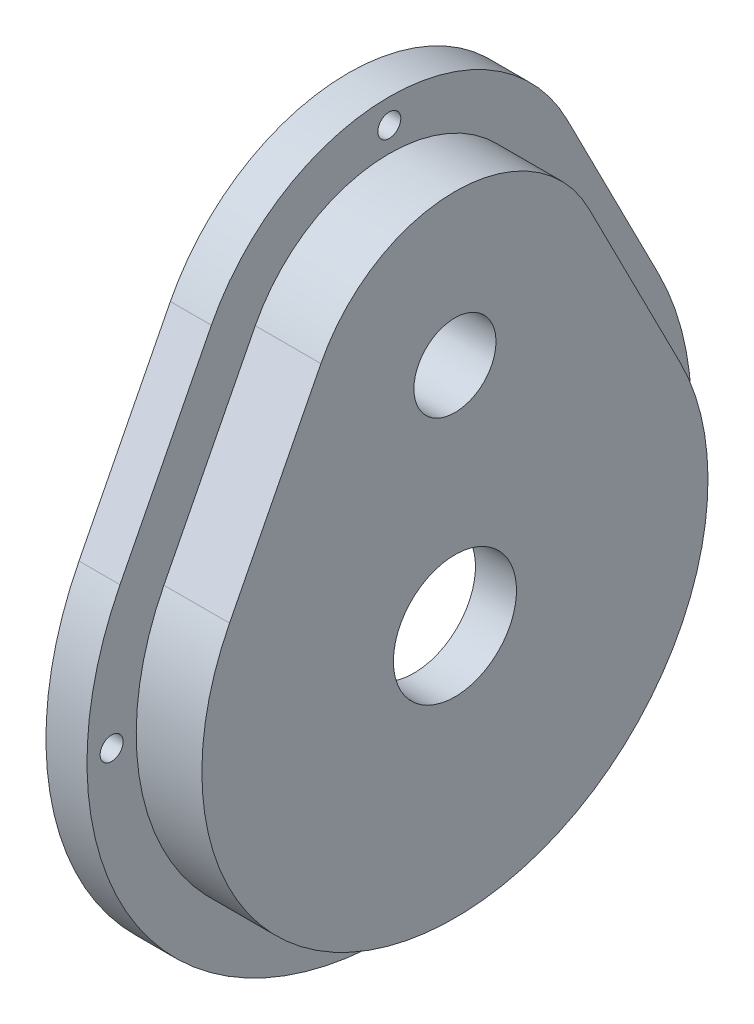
ISO-10303-21;
HEADER;
FILE_DESCRIPTION(('STEP AP214'),'2;1');
FILE_NAME('part.step','',(''),(''),'','','');
FILE_SCHEMA(('AUTOMOTIVE_DESIGN { 1 0 10303 214 1 1 1 1 }'));
ENDSEC;
DATA;
#1=APPLICATION_CONTEXT('core data for automotive mechanical design processes');
#2=APPLICATION_PROTOCOL_DEFINITION('international standard','automotive_design',2000,#1);
#3=PRODUCT_CONTEXT('',#1,'mechanical');
#4=PRODUCT('Part','Part','',(#3));
#5=PRODUCT_RELATED_PRODUCT_CATEGORY('part','',(#4));
#6=PRODUCT_DEFINITION_FORMATION('','',#4);
#7=PRODUCT_DEFINITION_CONTEXT('part definition',#1,'design');
#8=PRODUCT_DEFINITION('design','',#6,#7);
#9=PRODUCT_DEFINITION_SHAPE('','',#8);
#10=(LENGTH_UNIT() NAMED_UNIT(*) SI_UNIT(.MILLI.,.METRE.));
#11=(NAMED_UNIT(*) PLANE_ANGLE_UNIT() SI_UNIT($,.RADIAN.));
#12=(NAMED_UNIT(*) SI_UNIT($,.STERADIAN.) SOLID_ANGLE_UNIT());
#13=UNCERTAINTY_MEASURE_WITH_UNIT(LENGTH_MEASURE(1.E-05),#10,'distance_accuracy_value','');
#14=(GEOMETRIC_REPRESENTATION_CONTEXT(3) GLOBAL_UNCERTAINTY_ASSIGNED_CONTEXT((#13)) GLOBAL_UNIT_ASSIGNED_CONTEXT((#10,
#11,#12)) REPRESENTATION_CONTEXT('',''));
#15=CARTESIAN_POINT('',(0.,0.,0.));
#16=DIRECTION('',(0.,0.,1.));
#17=DIRECTION('',(1.,0.,0.));
#18=AXIS2_PLACEMENT_3D('',#15,#16,#17);
#19=CARTESIAN_POINT('',(0.,17.4625,0.));
#20=DIRECTION('',(1.,0.,0.));
#21=DIRECTION('',(0.,0.,-1.));
#22=AXIS2_PLACEMENT_3D('',#19,#20,#21);
#23=PLANE('',#22);
#24=DIRECTION('',(0.,0.890723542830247,0.454545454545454));
#25=VECTOR('',#24,1.);
#26=CARTESIAN_POINT('',(0.,7.45663181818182,-14.6119545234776));
#27=LINE('',#26,#25);
#28=CARTESIAN_POINT('',(0.,7.45663181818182,-14.6119545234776));
#29=VERTEX_POINT('',#28);
#30=CARTESIAN_POINT('',(0.,21.3111772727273,-7.54183640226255));
#31=VERTEX_POINT('',#30);
#32=EDGE_CURVE('E263',#29,#31,#27,.T.);
#33=ORIENTED_EDGE('',*,*,#32,.F.);
#34=CARTESIAN_POINT('',(0.,0.,0.));
#35=DIRECTION('',(1.,0.,0.));
#36=DIRECTION('',(0.,0.,-1.));
#37=AXIS2_PLACEMENT_3D('',#34,#35,#36);
#38=CIRCLE('',#37,16.40459);
#39=CARTESIAN_POINT('',(0.,7.45663181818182,14.6119545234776));
#40=VERTEX_POINT('',#39);
#41=EDGE_CURVE('E276',#40,#29,#38,.T.);
#42=ORIENTED_EDGE('',*,*,#41,.F.);
#43=DIRECTION('',(0.,0.890723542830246,-0.454545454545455));
#44=VECTOR('',#43,1.);
#45=CARTESIAN_POINT('',(0.,7.45663181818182,14.6119545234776));
#46=LINE('',#45,#44);
#47=CARTESIAN_POINT('',(0.,21.3111772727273,7.54183640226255));
#48=VERTEX_POINT('',#47);
#49=EDGE_CURVE('E296',#40,#48,#46,.T.);
#50=ORIENTED_EDGE('',*,*,#49,.T.);
#51=CARTESIAN_POINT('',(0.,17.4625,0.));
#52=DIRECTION('',(1.,0.,0.));
#53=DIRECTION('',(0.,0.,-1.));
#54=AXIS2_PLACEMENT_3D('',#51,#52,#53);
#55=CIRCLE('',#54,8.46709);
#56=EDGE_CURVE('E292',#31,#48,#55,.T.);
#57=ORIENTED_EDGE('',*,*,#56,.F.);
#58=EDGE_LOOP('',(#33,#42,#50,#57));
#59=FACE_BOUND('',#58,.T.);
#60=CARTESIAN_POINT('',(0.,0.,0.));
#61=DIRECTION('',(-1.,0.,0.));
#62=DIRECTION('',(0.,0.,1.));
#63=AXIS2_PLACEMENT_3D('',#60,#61,#62);
#64=CIRCLE('',#63,4.7625);
#65=CARTESIAN_POINT('',(0.,0.,4.7625));
#66=VERTEX_POINT('',#65);
#67=EDGE_CURVE('E264',#66,#66,#64,.T.);
#68=ORIENTED_EDGE('',*,*,#67,.F.);
#69=EDGE_LOOP('',(#68));
#70=FACE_BOUND('',#69,.T.);
#71=CARTESIAN_POINT('',(0.,17.4625,0.));
#72=DIRECTION('',(1.,0.,0.));
#73=DIRECTION('',(0.,0.,-1.));
#74=AXIS2_PLACEMENT_3D('',#71,#72,#73);
#75=CIRCLE('',#74,3.556);
#76=CARTESIAN_POINT('',(0.,17.4625,-3.556));
#77=VERTEX_POINT('',#76);
#78=EDGE_CURVE('E12',#77,#77,#75,.F.);
#79=ORIENTED_EDGE('',*,*,#78,.F.);
#80=EDGE_LOOP('',(#79));
#81=FACE_BOUND('',#80,.T.);
#82=ADVANCED_FACE('F71',(#59,#70,#81),#23,.F.);
#83=CARTESIAN_POINT('',(3.175,8.89981363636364,17.4400017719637));
#84=DIRECTION('',(0.,0.454545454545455,0.890723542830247));
#85=DIRECTION('',(0.,-0.890723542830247,0.454545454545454));
#86=AXIS2_PLACEMENT_3D('',#83,#84,#85);
#87=PLANE('',#86);
#88=DIRECTION('',(-1.,0.,0.));
#89=VECTOR('',#88,1.);
#90=CARTESIAN_POINT('',(3.175,22.7543590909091,10.3698836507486));
#91=LINE('',#90,#89);
#92=CARTESIAN_POINT('',(3.175,22.7543590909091,10.3698836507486));
#93=VERTEX_POINT('',#92);
#94=CARTESIAN_POINT('',(-1.905,22.7543590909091,10.3698836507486));
#95=VERTEX_POINT('',#94);
#96=EDGE_CURVE('E174',#93,#95,#91,.T.);
#97=ORIENTED_EDGE('',*,*,#96,.T.);
#98=DIRECTION('',(0.,0.890723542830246,-0.454545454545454));
#99=VECTOR('',#98,1.);
#100=CARTESIAN_POINT('',(-1.905,8.89981363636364,17.4400017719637));
#101=LINE('',#100,#99);
#102=CARTESIAN_POINT('',(-1.905,8.89981363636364,17.4400017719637));
#103=VERTEX_POINT('',#102);
#104=EDGE_CURVE('E87',#103,#95,#101,.T.);
#105=ORIENTED_EDGE('',*,*,#104,.F.);
#106=DIRECTION('',(-1.,0.,0.));
#107=VECTOR('',#106,1.);
#108=CARTESIAN_POINT('',(3.175,8.89981363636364,17.4400017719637));
#109=LINE('',#108,#107);
#110=CARTESIAN_POINT('',(3.175,8.89981363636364,17.4400017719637));
#111=VERTEX_POINT('',#110);
#112=EDGE_CURVE('E80',#111,#103,#109,.T.);
#113=ORIENTED_EDGE('',*,*,#112,.F.);
#114=DIRECTION('',(0.,0.890723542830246,-0.454545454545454));
#115=VECTOR('',#114,1.);
#116=CARTESIAN_POINT('',(3.175,8.89981363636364,17.4400017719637));
#117=LINE('',#116,#115);
#118=EDGE_CURVE('E306',#111,#93,#117,.T.);
#119=ORIENTED_EDGE('',*,*,#118,.T.);
#120=EDGE_LOOP('',(#97,#105,#113,#119));
#121=FACE_BOUND('',#120,.T.);
#122=ADVANCED_FACE('F73',(#121),#87,.T.);
#123=CARTESIAN_POINT('',(3.175,0.,0.));
#124=DIRECTION('',(-1.,0.,0.));
#125=DIRECTION('',(0.,0.,1.));
#126=AXIS2_PLACEMENT_3D('',#123,#124,#125);
#127=CYLINDRICAL_SURFACE('',#126,19.57959);
#128=CARTESIAN_POINT('',(-1.905,0.,0.));
#129=DIRECTION('',(-1.,0.,0.));
#130=DIRECTION('',(0.,0.,1.));
#131=AXIS2_PLACEMENT_3D('',#128,#129,#130);
#132=CIRCLE('',#131,19.57959);
#133=CARTESIAN_POINT('',(-1.905,8.89981363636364,-17.4400017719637));
#134=VERTEX_POINT('',#133);
#135=EDGE_CURVE('E94',#134,#103,#132,.T.);
#136=ORIENTED_EDGE('',*,*,#135,.F.);
#137=DIRECTION('',(-1.,0.,0.));
#138=VECTOR('',#137,1.);
#139=CARTESIAN_POINT('',(3.175,8.89981363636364,-17.4400017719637));
#140=LINE('',#139,#138);
#141=CARTESIAN_POINT('',(3.175,8.89981363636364,-17.4400017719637));
#142=VERTEX_POINT('',#141);
#143=EDGE_CURVE('E173',#142,#134,#140,.T.);
#144=ORIENTED_EDGE('',*,*,#143,.F.);
#145=CARTESIAN_POINT('',(3.175,0.,0.));
#146=DIRECTION('',(1.,0.,0.));
#147=DIRECTION('',(0.,0.,-1.));
#148=AXIS2_PLACEMENT_3D('',#145,#146,#147);
#149=CIRCLE('',#148,19.57959);
#150=EDGE_CURVE('E326',#111,#142,#149,.T.);
#151=ORIENTED_EDGE('',*,*,#150,.F.);
#152=ORIENTED_EDGE('',*,*,#112,.T.);
#153=EDGE_LOOP('',(#136,#144,#151,#152));
#154=FACE_BOUND('',#153,.T.);
#155=ADVANCED_FACE('F337',(#154),#127,.T.);
#156=CARTESIAN_POINT('',(3.175,8.89981363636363,-17.4400017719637));
#157=DIRECTION('',(0.,-0.454545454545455,0.890723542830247));
#158=DIRECTION('',(0.,-0.890723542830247,-0.454545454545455));
#159=AXIS2_PLACEMENT_3D('',#156,#157,#158);
#160=PLANE('',#159);
#161=DIRECTION('',(0.,-0.890723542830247,-0.454545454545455));
#162=VECTOR('',#161,1.);
#163=CARTESIAN_POINT('',(-1.905,8.89981363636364,-17.4400017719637));
#164=LINE('',#163,#162);
#165=CARTESIAN_POINT('',(-1.905,22.7543590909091,-10.3698836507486));
#166=VERTEX_POINT('',#165);
#167=EDGE_CURVE('E177',#166,#134,#164,.T.);
#168=ORIENTED_EDGE('',*,*,#167,.F.);
#169=DIRECTION('',(-1.,0.,0.));
#170=VECTOR('',#169,1.);
#171=CARTESIAN_POINT('',(3.175,22.7543590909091,-10.3698836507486));
#172=LINE('',#171,#170);
#173=CARTESIAN_POINT('',(3.175,22.7543590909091,-10.3698836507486));
#174=VERTEX_POINT('',#173);
#175=EDGE_CURVE('E163',#174,#166,#172,.T.);
#176=ORIENTED_EDGE('',*,*,#175,.F.);
#177=DIRECTION('',(0.,0.890723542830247,0.454545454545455));
#178=VECTOR('',#177,1.);
#179=CARTESIAN_POINT('',(3.175,8.89981363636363,-17.4400017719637));
#180=LINE('',#179,#178);
#181=EDGE_CURVE('E323',#142,#174,#180,.T.);
#182=ORIENTED_EDGE('',*,*,#181,.F.);
#183=ORIENTED_EDGE('',*,*,#143,.T.);
#184=EDGE_LOOP('',(#168,#176,#182,#183));
#185=FACE_BOUND('',#184,.T.);
#186=ADVANCED_FACE('F178',(#185),#160,.F.);
#187=CARTESIAN_POINT('',(3.175,17.4625,0.));
#188=DIRECTION('',(-1.,0.,0.));
#189=DIRECTION('',(0.,0.,1.));
#190=AXIS2_PLACEMENT_3D('',#187,#188,#189);
#191=CYLINDRICAL_SURFACE('',#190,11.64209);
#192=CARTESIAN_POINT('',(-1.905,17.4625,0.));
#193=DIRECTION('',(-1.,0.,0.));
#194=DIRECTION('',(0.,0.,1.));
#195=AXIS2_PLACEMENT_3D('',#192,#193,#194);
#196=CIRCLE('',#195,11.64209);
#197=EDGE_CURVE('E168',#95,#166,#196,.T.);
#198=ORIENTED_EDGE('',*,*,#197,.F.);
#199=ORIENTED_EDGE('',*,*,#96,.F.);
#200=CARTESIAN_POINT('',(3.175,17.4625,0.));
#201=DIRECTION('',(1.,0.,0.));
#202=DIRECTION('',(0.,0.,-1.));
#203=AXIS2_PLACEMENT_3D('',#200,#201,#202);
#204=CIRCLE('',#203,11.64209);
#205=EDGE_CURVE('E169',#174,#93,#204,.T.);
#206=ORIENTED_EDGE('',*,*,#205,.F.);
#207=ORIENTED_EDGE('',*,*,#175,.T.);
#208=EDGE_LOOP('',(#198,#199,#206,#207));
#209=FACE_BOUND('',#208,.T.);
#210=ADVANCED_FACE('F165',(#209),#191,.T.);
#211=CARTESIAN_POINT('',(3.175,17.4625,0.));
#212=DIRECTION('',(1.,0.,0.));
#213=DIRECTION('',(0.,0.,-1.));
#214=AXIS2_PLACEMENT_3D('',#211,#212,#213);
#215=PLANE('',#214);
#216=CARTESIAN_POINT('',(3.175,0.,0.));
#217=DIRECTION('',(-1.,0.,0.));
#218=DIRECTION('',(0.,0.,1.));
#219=AXIS2_PLACEMENT_3D('',#216,#217,#218);
#220=CIRCLE('',#219,4.7625);
#221=CARTESIAN_POINT('',(3.175,0.,4.7625));
#222=VERTEX_POINT('',#221);
#223=EDGE_CURVE('E259',#222,#222,#220,.T.);
#224=ORIENTED_EDGE('',*,*,#223,.T.);
#225=EDGE_LOOP('',(#224));
#226=FACE_BOUND('',#225,.T.);
#227=CARTESIAN_POINT('',(3.175,17.4625,0.));
#228=DIRECTION('',(-1.,0.,0.));
#229=DIRECTION('',(0.,0.,1.));
#230=AXIS2_PLACEMENT_3D('',#227,#228,#229);
#231=CIRCLE('',#230,3.175);
#232=CARTESIAN_POINT('',(3.175,17.4625,3.175));
#233=VERTEX_POINT('',#232);
#234=EDGE_CURVE('E250',#233,#233,#231,.T.);
#235=ORIENTED_EDGE('',*,*,#234,.T.);
#236=EDGE_LOOP('',(#235));
#237=FACE_BOUND('',#236,.T.);
#238=ORIENTED_EDGE('',*,*,#118,.F.);
#239=ORIENTED_EDGE('',*,*,#150,.T.);
#240=ORIENTED_EDGE('',*,*,#181,.T.);
#241=ORIENTED_EDGE('',*,*,#205,.T.);
#242=EDGE_LOOP('',(#238,#239,#240,#241));
#243=FACE_BOUND('',#242,.T.);
#244=ADVANCED_FACE('F336',(#226,#237,#243),#215,.T.);
#245=CARTESIAN_POINT('',(-5.08,17.4625,0.));
#246=DIRECTION('',(1.,0.,0.));
#247=DIRECTION('',(0.,0.,-1.));
#248=AXIS2_PLACEMENT_3D('',#245,#246,#247);
#249=PLANE('',#248);
#250=CARTESIAN_POINT('',(-5.08,0.,0.));
#251=DIRECTION('',(1.,0.,0.));
#252=DIRECTION('',(0.,0.,-1.));
#253=AXIS2_PLACEMENT_3D('',#250,#251,#252);
#254=CIRCLE('',#253,16.40459);
#255=CARTESIAN_POINT('',(-5.08,7.45663181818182,14.6119545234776));
#256=VERTEX_POINT('',#255);
#257=CARTESIAN_POINT('',(-5.08,7.45663181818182,-14.6119545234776));
#258=VERTEX_POINT('',#257);
#259=EDGE_CURVE('E284',#256,#258,#254,.T.);
#260=ORIENTED_EDGE('',*,*,#259,.T.);
#261=DIRECTION('',(0.,0.890723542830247,0.454545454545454));
#262=VECTOR('',#261,1.);
#263=CARTESIAN_POINT('',(-5.08,7.45663181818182,-14.6119545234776));
#264=LINE('',#263,#262);
#265=CARTESIAN_POINT('',(-5.08,21.3111772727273,-7.54183640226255));
#266=VERTEX_POINT('',#265);
#267=EDGE_CURVE('E271',#258,#266,#264,.T.);
#268=ORIENTED_EDGE('',*,*,#267,.T.);
#269=CARTESIAN_POINT('',(-5.08,17.4625,0.));
#270=DIRECTION('',(1.,0.,0.));
#271=DIRECTION('',(0.,0.,-1.));
#272=AXIS2_PLACEMENT_3D('',#269,#270,#271);
#273=CIRCLE('',#272,8.46709);
#274=CARTESIAN_POINT('',(-5.08,21.3111772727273,7.54183640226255));
#275=VERTEX_POINT('',#274);
#276=EDGE_CURVE('E275',#266,#275,#273,.T.);
#277=ORIENTED_EDGE('',*,*,#276,.T.);
#278=DIRECTION('',(0.,0.890723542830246,-0.454545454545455));
#279=VECTOR('',#278,1.);
#280=CARTESIAN_POINT('',(-5.08,7.45663181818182,14.6119545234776));
#281=LINE('',#280,#279);
#282=EDGE_CURVE('E280',#256,#275,#281,.T.);
#283=ORIENTED_EDGE('',*,*,#282,.F.);
#284=EDGE_LOOP('',(#260,#268,#277,#283));
#285=FACE_BOUND('',#284,.T.);
#286=CARTESIAN_POINT('',(-5.08,0.,-21.48459));
#287=DIRECTION('',(-1.,0.,0.));
#288=DIRECTION('',(0.,0.,1.));
#289=AXIS2_PLACEMENT_3D('',#286,#287,#288);
#290=CIRCLE('',#289,0.889);
#291=CARTESIAN_POINT('',(-5.08,0.,-20.59559));
#292=VERTEX_POINT('',#291);
#293=EDGE_CURVE('E438',#292,#292,#290,.T.);
#294=ORIENTED_EDGE('',*,*,#293,.F.);
#295=EDGE_LOOP('',(#294));
#296=FACE_BOUND('',#295,.T.);
#297=CARTESIAN_POINT('',(-5.08,0.,21.48459));
#298=DIRECTION('',(-1.,0.,0.));
#299=DIRECTION('',(0.,0.,1.));
#300=AXIS2_PLACEMENT_3D('',#297,#298,#299);
#301=CIRCLE('',#300,0.889);
#302=CARTESIAN_POINT('',(-5.08,0.,22.37359));
#303=VERTEX_POINT('',#302);
#304=EDGE_CURVE('E181',#303,#303,#301,.T.);
#305=ORIENTED_EDGE('',*,*,#304,.F.);
#306=EDGE_LOOP('',(#305));
#307=FACE_BOUND('',#306,.T.);
#308=CARTESIAN_POINT('',(-5.08,-21.48459,0.));
#309=DIRECTION('',(-1.,0.,0.));
#310=DIRECTION('',(0.,0.,1.));
#311=AXIS2_PLACEMENT_3D('',#308,#309,#310);
#312=CIRCLE('',#311,0.889);
#313=CARTESIAN_POINT('',(-5.08,-21.48459,0.889));
#314=VERTEX_POINT('',#313);
#315=EDGE_CURVE('E195',#314,#314,#312,.T.);
#316=ORIENTED_EDGE('',*,*,#315,.F.);
#317=EDGE_LOOP('',(#316));
#318=FACE_BOUND('',#317,.T.);
#319=CARTESIAN_POINT('',(-5.08,31.00959,0.));
#320=DIRECTION('',(-1.,0.,0.));
#321=DIRECTION('',(0.,0.,1.));
#322=AXIS2_PLACEMENT_3D('',#319,#320,#321);
#323=CIRCLE('',#322,0.889);
#324=CARTESIAN_POINT('',(-5.08,31.00959,0.889));
#325=VERTEX_POINT('',#324);
#326=EDGE_CURVE('E203',#325,#325,#323,.T.);
#327=ORIENTED_EDGE('',*,*,#326,.F.);
#328=EDGE_LOOP('',(#327));
#329=FACE_BOUND('',#328,.T.);
#330=CARTESIAN_POINT('',(-5.08,17.4625,0.));
#331=DIRECTION('',(-1.,0.,0.));
#332=DIRECTION('',(0.,0.,1.));
#333=AXIS2_PLACEMENT_3D('',#330,#331,#332);
#334=CIRCLE('',#333,15.45209);
#335=CARTESIAN_POINT('',(-5.08,24.4861772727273,13.7635403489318));
#336=VERTEX_POINT('',#335);
#337=CARTESIAN_POINT('',(-5.08,24.4861772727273,-13.7635403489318));
#338=VERTEX_POINT('',#337);
#339=EDGE_CURVE('E211',#336,#338,#334,.T.);
#340=ORIENTED_EDGE('',*,*,#339,.T.);
#341=DIRECTION('',(0.,-0.890723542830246,-0.454545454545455));
#342=VECTOR('',#341,1.);
#343=CARTESIAN_POINT('',(-5.08,24.4861772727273,-13.7635403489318));
#344=LINE('',#343,#342);
#345=CARTESIAN_POINT('',(-5.08,10.6316318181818,-20.8336584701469));
#346=VERTEX_POINT('',#345);
#347=EDGE_CURVE('E236',#338,#346,#344,.T.);
#348=ORIENTED_EDGE('',*,*,#347,.T.);
#349=CARTESIAN_POINT('',(-5.08,0.,0.));
#350=DIRECTION('',(-1.,0.,0.));
#351=DIRECTION('',(0.,0.,1.));
#352=AXIS2_PLACEMENT_3D('',#349,#350,#351);
#353=CIRCLE('',#352,23.38959);
#354=CARTESIAN_POINT('',(-5.08,10.6316318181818,20.8336584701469));
#355=VERTEX_POINT('',#354);
#356=EDGE_CURVE('E240',#346,#355,#353,.T.);
#357=ORIENTED_EDGE('',*,*,#356,.T.);
#358=DIRECTION('',(0.,0.890723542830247,-0.454545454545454));
#359=VECTOR('',#358,1.);
#360=CARTESIAN_POINT('',(-5.08,10.6316318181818,20.8336584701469));
#361=LINE('',#360,#359);
#362=EDGE_CURVE('E220',#355,#336,#361,.T.);
#363=ORIENTED_EDGE('',*,*,#362,.T.);
#364=EDGE_LOOP('',(#340,#348,#357,#363));
#365=FACE_BOUND('',#364,.T.);
#366=ADVANCED_FACE('F356',(#285,#296,#307,#318,#329,#365),#249,.F.);
#367=CARTESIAN_POINT('',(-5.08,7.45663181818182,-14.6119545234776));
#368=DIRECTION('',(0.,0.454545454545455,-0.890723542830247));
#369=DIRECTION('',(0.,0.890723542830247,0.454545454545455));
#370=AXIS2_PLACEMENT_3D('',#367,#368,#369);
#371=PLANE('',#370);
#372=ORIENTED_EDGE('',*,*,#32,.T.);
#373=DIRECTION('',(1.,0.,0.));
#374=VECTOR('',#373,1.);
#375=CARTESIAN_POINT('',(-5.08,21.3111772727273,-7.54183640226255));
#376=LINE('',#375,#374);
#377=EDGE_CURVE('E288',#266,#31,#376,.T.);
#378=ORIENTED_EDGE('',*,*,#377,.F.);
#379=ORIENTED_EDGE('',*,*,#267,.F.);
#380=DIRECTION('',(1.,0.,0.));
#381=VECTOR('',#380,1.);
#382=CARTESIAN_POINT('',(-5.08,7.45663181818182,-14.6119545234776));
#383=LINE('',#382,#381);
#384=EDGE_CURVE('E302',#258,#29,#383,.T.);
#385=ORIENTED_EDGE('',*,*,#384,.T.);
#386=EDGE_LOOP('',(#372,#378,#379,#385));
#387=FACE_BOUND('',#386,.T.);
#388=ADVANCED_FACE('F360',(#387),#371,.F.);
#389=CARTESIAN_POINT('',(-5.08,0.,0.));
#390=DIRECTION('',(1.,0.,0.));
#391=DIRECTION('',(0.,0.,-1.));
#392=AXIS2_PLACEMENT_3D('',#389,#390,#391);
#393=CYLINDRICAL_SURFACE('',#392,16.40459);
#394=ORIENTED_EDGE('',*,*,#41,.T.);
#395=ORIENTED_EDGE('',*,*,#384,.F.);
#396=ORIENTED_EDGE('',*,*,#259,.F.);
#397=DIRECTION('',(1.,0.,0.));
#398=VECTOR('',#397,1.);
#399=CARTESIAN_POINT('',(-5.08,7.45663181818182,14.6119545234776));
#400=LINE('',#399,#398);
#401=EDGE_CURVE('E307',#256,#40,#400,.T.);
#402=ORIENTED_EDGE('',*,*,#401,.T.);
#403=EDGE_LOOP('',(#394,#395,#396,#402));
#404=FACE_BOUND('',#403,.T.);
#405=ADVANCED_FACE('F364',(#404),#393,.F.);
#406=CARTESIAN_POINT('',(-5.08,7.45663181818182,14.6119545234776));
#407=DIRECTION('',(0.,-0.454545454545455,-0.890723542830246));
#408=DIRECTION('',(0.,0.890723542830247,-0.454545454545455));
#409=AXIS2_PLACEMENT_3D('',#406,#407,#408);
#410=PLANE('',#409);
#411=ORIENTED_EDGE('',*,*,#49,.F.);
#412=ORIENTED_EDGE('',*,*,#401,.F.);
#413=ORIENTED_EDGE('',*,*,#282,.T.);
#414=DIRECTION('',(1.,0.,0.));
#415=VECTOR('',#414,1.);
#416=CARTESIAN_POINT('',(-5.08,21.3111772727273,7.54183640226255));
#417=LINE('',#416,#415);
#418=EDGE_CURVE('E311',#275,#48,#417,.T.);
#419=ORIENTED_EDGE('',*,*,#418,.T.);
#420=EDGE_LOOP('',(#411,#412,#413,#419));
#421=FACE_BOUND('',#420,.T.);
#422=ADVANCED_FACE('F370',(#421),#410,.T.);
#423=CARTESIAN_POINT('',(-5.08,17.4625,0.));
#424=DIRECTION('',(1.,0.,0.));
#425=DIRECTION('',(0.,0.,-1.));
#426=AXIS2_PLACEMENT_3D('',#423,#424,#425);
#427=CYLINDRICAL_SURFACE('',#426,8.46709);
#428=ORIENTED_EDGE('',*,*,#56,.T.);
#429=ORIENTED_EDGE('',*,*,#418,.F.);
#430=ORIENTED_EDGE('',*,*,#276,.F.);
#431=ORIENTED_EDGE('',*,*,#377,.T.);
#432=EDGE_LOOP('',(#428,#429,#430,#431));
#433=FACE_BOUND('',#432,.T.);
#434=ADVANCED_FACE('F366',(#433),#427,.F.);
#435=CARTESIAN_POINT('',(3.175,17.4625,0.));
#436=DIRECTION('',(-1.,0.,0.));
#437=DIRECTION('',(0.,0.,1.));
#438=AXIS2_PLACEMENT_3D('',#435,#436,#437);
#439=CYLINDRICAL_SURFACE('',#438,3.175);
#440=ORIENTED_EDGE('',*,*,#234,.F.);
#441=EDGE_LOOP('',(#440));
#442=FACE_BOUND('',#441,.T.);
#443=CARTESIAN_POINT('',(-1.524,17.4625,0.));
#444=DIRECTION('',(-1.,0.,0.));
#445=DIRECTION('',(0.,0.,1.));
#446=AXIS2_PLACEMENT_3D('',#443,#444,#445);
#447=CIRCLE('',#446,3.17500000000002);
#448=CARTESIAN_POINT('',(-1.524,17.4625,3.17500000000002));
#449=VERTEX_POINT('',#448);
#450=EDGE_CURVE('E433',#449,#449,#447,.T.);
#451=ORIENTED_EDGE('',*,*,#450,.T.);
#452=EDGE_LOOP('',(#451));
#453=FACE_BOUND('',#452,.T.);
#454=ADVANCED_FACE('F369',(#442,#453),#439,.F.);
#455=CARTESIAN_POINT('',(3.175,0.,0.));
#456=DIRECTION('',(-1.,0.,0.));
#457=DIRECTION('',(0.,0.,1.));
#458=AXIS2_PLACEMENT_3D('',#455,#456,#457);
#459=CYLINDRICAL_SURFACE('',#458,4.7625);
#460=ORIENTED_EDGE('',*,*,#223,.F.);
#461=EDGE_LOOP('',(#460));
#462=FACE_BOUND('',#461,.T.);
#463=ORIENTED_EDGE('',*,*,#67,.T.);
#464=EDGE_LOOP('',(#463));
#465=FACE_BOUND('',#464,.T.);
#466=ADVANCED_FACE('F379',(#462,#465),#459,.F.);
#467=CARTESIAN_POINT('',(-1.905,17.4625,0.));
#468=DIRECTION('',(-1.,0.,0.));
#469=DIRECTION('',(0.,0.,1.));
#470=AXIS2_PLACEMENT_3D('',#467,#468,#469);
#471=CYLINDRICAL_SURFACE('',#470,15.45209);
#472=ORIENTED_EDGE('',*,*,#339,.F.);
#473=DIRECTION('',(-1.,0.,0.));
#474=VECTOR('',#473,1.);
#475=CARTESIAN_POINT('',(-1.905,24.4861772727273,13.7635403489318));
#476=LINE('',#475,#474);
#477=CARTESIAN_POINT('',(-1.905,24.4861772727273,13.7635403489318));
#478=VERTEX_POINT('',#477);
#479=EDGE_CURVE('E247',#478,#336,#476,.T.);
#480=ORIENTED_EDGE('',*,*,#479,.F.);
#481=CARTESIAN_POINT('',(-1.905,17.4625,0.));
#482=DIRECTION('',(-1.,0.,0.));
#483=DIRECTION('',(0.,0.,1.));
#484=AXIS2_PLACEMENT_3D('',#481,#482,#483);
#485=CIRCLE('',#484,15.45209);
#486=CARTESIAN_POINT('',(-1.905,24.4861772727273,-13.7635403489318));
#487=VERTEX_POINT('',#486);
#488=EDGE_CURVE('E215',#478,#487,#485,.T.);
#489=ORIENTED_EDGE('',*,*,#488,.T.);
#490=DIRECTION('',(-1.,0.,0.));
#491=VECTOR('',#490,1.);
#492=CARTESIAN_POINT('',(-1.905,24.4861772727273,-13.7635403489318));
#493=LINE('',#492,#491);
#494=EDGE_CURVE('E232',#487,#338,#493,.T.);
#495=ORIENTED_EDGE('',*,*,#494,.T.);
#496=EDGE_LOOP('',(#472,#480,#489,#495));
#497=FACE_BOUND('',#496,.T.);
#498=ADVANCED_FACE('F383',(#497),#471,.T.);
#499=CARTESIAN_POINT('',(-1.905,10.6316318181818,20.8336584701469));
#500=DIRECTION('',(0.,0.454545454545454,0.890723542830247));
#501=DIRECTION('',(0.,-0.890723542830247,0.454545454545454));
#502=AXIS2_PLACEMENT_3D('',#499,#500,#501);
#503=PLANE('',#502);
#504=ORIENTED_EDGE('',*,*,#362,.F.);
#505=DIRECTION('',(-1.,0.,0.));
#506=VECTOR('',#505,1.);
#507=CARTESIAN_POINT('',(-1.905,10.6316318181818,20.8336584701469));
#508=LINE('',#507,#506);
#509=CARTESIAN_POINT('',(-1.905,10.6316318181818,20.8336584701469));
#510=VERTEX_POINT('',#509);
#511=EDGE_CURVE('E251',#510,#355,#508,.T.);
#512=ORIENTED_EDGE('',*,*,#511,.F.);
#513=DIRECTION('',(0.,0.890723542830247,-0.454545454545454));
#514=VECTOR('',#513,1.);
#515=CARTESIAN_POINT('',(-1.905,10.6316318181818,20.8336584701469));
#516=LINE('',#515,#514);
#517=EDGE_CURVE('E228',#510,#478,#516,.T.);
#518=ORIENTED_EDGE('',*,*,#517,.T.);
#519=ORIENTED_EDGE('',*,*,#479,.T.);
#520=EDGE_LOOP('',(#504,#512,#518,#519));
#521=FACE_BOUND('',#520,.T.);
#522=ADVANCED_FACE('F387',(#521),#503,.T.);
#523=CARTESIAN_POINT('',(-1.905,0.,0.));
#524=DIRECTION('',(-1.,0.,0.));
#525=DIRECTION('',(0.,0.,1.));
#526=AXIS2_PLACEMENT_3D('',#523,#524,#525);
#527=CYLINDRICAL_SURFACE('',#526,23.38959);
#528=ORIENTED_EDGE('',*,*,#356,.F.);
#529=DIRECTION('',(-1.,0.,0.));
#530=VECTOR('',#529,1.);
#531=CARTESIAN_POINT('',(-1.905,10.6316318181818,-20.8336584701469));
#532=LINE('',#531,#530);
#533=CARTESIAN_POINT('',(-1.905,10.6316318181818,-20.8336584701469));
#534=VERTEX_POINT('',#533);
#535=EDGE_CURVE('E254',#534,#346,#532,.T.);
#536=ORIENTED_EDGE('',*,*,#535,.F.);
#537=CARTESIAN_POINT('',(-1.905,0.,0.));
#538=DIRECTION('',(-1.,0.,0.));
#539=DIRECTION('',(0.,0.,1.));
#540=AXIS2_PLACEMENT_3D('',#537,#538,#539);
#541=CIRCLE('',#540,23.38959);
#542=EDGE_CURVE('E224',#534,#510,#541,.T.);
#543=ORIENTED_EDGE('',*,*,#542,.T.);
#544=ORIENTED_EDGE('',*,*,#511,.T.);
#545=EDGE_LOOP('',(#528,#536,#543,#544));
#546=FACE_BOUND('',#545,.T.);
#547=ADVANCED_FACE('F392',(#546),#527,.T.);
#548=CARTESIAN_POINT('',(-1.905,24.4861772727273,-13.7635403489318));
#549=DIRECTION('',(0.,0.454545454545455,-0.890723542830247));
#550=DIRECTION('',(0.,0.890723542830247,0.454545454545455));
#551=AXIS2_PLACEMENT_3D('',#548,#549,#550);
#552=PLANE('',#551);
#553=ORIENTED_EDGE('',*,*,#347,.F.);
#554=ORIENTED_EDGE('',*,*,#494,.F.);
#555=DIRECTION('',(0.,-0.890723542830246,-0.454545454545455));
#556=VECTOR('',#555,1.);
#557=CARTESIAN_POINT('',(-1.905,24.4861772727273,-13.7635403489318));
#558=LINE('',#557,#556);
#559=EDGE_CURVE('E219',#487,#534,#558,.T.);
#560=ORIENTED_EDGE('',*,*,#559,.T.);
#561=ORIENTED_EDGE('',*,*,#535,.T.);
#562=EDGE_LOOP('',(#553,#554,#560,#561));
#563=FACE_BOUND('',#562,.T.);
#564=ADVANCED_FACE('F389',(#563),#552,.T.);
#565=CARTESIAN_POINT('',(-1.905,17.4625,0.));
#566=DIRECTION('',(-1.,0.,0.));
#567=DIRECTION('',(0.,0.,1.));
#568=AXIS2_PLACEMENT_3D('',#565,#566,#567);
#569=PLANE('',#568);
#570=CARTESIAN_POINT('',(-1.905,0.,-21.48459));
#571=DIRECTION('',(-1.,0.,0.));
#572=DIRECTION('',(0.,0.,1.));
#573=AXIS2_PLACEMENT_3D('',#570,#571,#572);
#574=CIRCLE('',#573,0.889);
#575=CARTESIAN_POINT('',(-1.905,0.,-20.59559));
#576=VERTEX_POINT('',#575);
#577=EDGE_CURVE('E441',#576,#576,#574,.T.);
#578=ORIENTED_EDGE('',*,*,#577,.T.);
#579=EDGE_LOOP('',(#578));
#580=FACE_BOUND('',#579,.T.);
#581=ORIENTED_EDGE('',*,*,#167,.T.);
#582=ORIENTED_EDGE('',*,*,#135,.T.);
#583=ORIENTED_EDGE('',*,*,#104,.T.);
#584=ORIENTED_EDGE('',*,*,#197,.T.);
#585=EDGE_LOOP('',(#581,#582,#583,#584));
#586=FACE_BOUND('',#585,.T.);
#587=CARTESIAN_POINT('',(-1.905,0.,21.48459));
#588=DIRECTION('',(-1.,0.,0.));
#589=DIRECTION('',(0.,0.,1.));
#590=AXIS2_PLACEMENT_3D('',#587,#588,#589);
#591=CIRCLE('',#590,0.889);
#592=CARTESIAN_POINT('',(-1.905,0.,22.37359));
#593=VERTEX_POINT('',#592);
#594=EDGE_CURVE('E191',#593,#593,#591,.T.);
#595=ORIENTED_EDGE('',*,*,#594,.T.);
#596=EDGE_LOOP('',(#595));
#597=FACE_BOUND('',#596,.T.);
#598=CARTESIAN_POINT('',(-1.905,-21.48459,0.));
#599=DIRECTION('',(-1.,0.,0.));
#600=DIRECTION('',(0.,0.,1.));
#601=AXIS2_PLACEMENT_3D('',#598,#599,#600);
#602=CIRCLE('',#601,0.889);
#603=CARTESIAN_POINT('',(-1.905,-21.48459,0.889));
#604=VERTEX_POINT('',#603);
#605=EDGE_CURVE('E199',#604,#604,#602,.T.);
#606=ORIENTED_EDGE('',*,*,#605,.T.);
#607=EDGE_LOOP('',(#606));
#608=FACE_BOUND('',#607,.T.);
#609=CARTESIAN_POINT('',(-1.905,31.00959,0.));
#610=DIRECTION('',(-1.,0.,0.));
#611=DIRECTION('',(0.,0.,1.));
#612=AXIS2_PLACEMENT_3D('',#609,#610,#611);
#613=CIRCLE('',#612,0.889);
#614=CARTESIAN_POINT('',(-1.905,31.00959,0.889));
#615=VERTEX_POINT('',#614);
#616=EDGE_CURVE('E207',#615,#615,#613,.T.);
#617=ORIENTED_EDGE('',*,*,#616,.T.);
#618=EDGE_LOOP('',(#617));
#619=FACE_BOUND('',#618,.T.);
#620=ORIENTED_EDGE('',*,*,#488,.F.);
#621=ORIENTED_EDGE('',*,*,#517,.F.);
#622=ORIENTED_EDGE('',*,*,#542,.F.);
#623=ORIENTED_EDGE('',*,*,#559,.F.);
#624=EDGE_LOOP('',(#620,#621,#622,#623));
#625=FACE_BOUND('',#624,.T.);
#626=ADVANCED_FACE('F183',(#580,#586,#597,#608,#619,#625),#569,.F.);
#627=CARTESIAN_POINT('',(-1.905,31.00959,0.));
#628=DIRECTION('',(-1.,0.,0.));
#629=DIRECTION('',(0.,0.,1.));
#630=AXIS2_PLACEMENT_3D('',#627,#628,#629);
#631=CYLINDRICAL_SURFACE('',#630,0.889);
#632=ORIENTED_EDGE('',*,*,#616,.F.);
#633=EDGE_LOOP('',(#632));
#634=FACE_BOUND('',#633,.T.);
#635=ORIENTED_EDGE('',*,*,#326,.T.);
#636=EDGE_LOOP('',(#635));
#637=FACE_BOUND('',#636,.T.);
#638=ADVANCED_FACE('F402',(#634,#637),#631,.F.);
#639=CARTESIAN_POINT('',(-1.905,-21.48459,0.));
#640=DIRECTION('',(-1.,0.,0.));
#641=DIRECTION('',(0.,0.,1.));
#642=AXIS2_PLACEMENT_3D('',#639,#640,#641);
#643=CYLINDRICAL_SURFACE('',#642,0.889);
#644=ORIENTED_EDGE('',*,*,#605,.F.);
#645=EDGE_LOOP('',(#644));
#646=FACE_BOUND('',#645,.T.);
#647=ORIENTED_EDGE('',*,*,#315,.T.);
#648=EDGE_LOOP('',(#647));
#649=FACE_BOUND('',#648,.T.);
#650=ADVANCED_FACE('F406',(#646,#649),#643,.F.);
#651=CARTESIAN_POINT('',(-1.905,0.,21.48459));
#652=DIRECTION('',(-1.,0.,0.));
#653=DIRECTION('',(0.,0.,1.));
#654=AXIS2_PLACEMENT_3D('',#651,#652,#653);
#655=CYLINDRICAL_SURFACE('',#654,0.889);
#656=ORIENTED_EDGE('',*,*,#594,.F.);
#657=EDGE_LOOP('',(#656));
#658=FACE_BOUND('',#657,.T.);
#659=ORIENTED_EDGE('',*,*,#304,.T.);
#660=EDGE_LOOP('',(#659));
#661=FACE_BOUND('',#660,.T.);
#662=ADVANCED_FACE('F410',(#658,#661),#655,.F.);
#663=CARTESIAN_POINT('',(-1.905,0.,-21.48459));
#664=DIRECTION('',(-1.,0.,0.));
#665=DIRECTION('',(0.,0.,1.));
#666=AXIS2_PLACEMENT_3D('',#663,#664,#665);
#667=CYLINDRICAL_SURFACE('',#666,0.889);
#668=ORIENTED_EDGE('',*,*,#577,.F.);
#669=EDGE_LOOP('',(#668));
#670=FACE_BOUND('',#669,.T.);
#671=ORIENTED_EDGE('',*,*,#293,.T.);
#672=EDGE_LOOP('',(#671));
#673=FACE_BOUND('',#672,.T.);
#674=ADVANCED_FACE('F414',(#670,#673),#667,.F.);
#675=CARTESIAN_POINT('',(-1.524,17.4625,0.));
#676=DIRECTION('',(-1.,0.,0.));
#677=DIRECTION('',(0.,0.,1.));
#678=AXIS2_PLACEMENT_3D('',#675,#676,#677);
#679=PLANE('',#678);
#680=CARTESIAN_POINT('',(-1.524,17.4625,0.));
#681=DIRECTION('',(-1.,0.,0.));
#682=DIRECTION('',(0.,0.,1.));
#683=AXIS2_PLACEMENT_3D('',#680,#681,#682);
#684=CIRCLE('',#683,3.556);
#685=CARTESIAN_POINT('',(-1.524,17.4625,-3.556));
#686=VERTEX_POINT('',#685);
#687=EDGE_CURVE('E430',#686,#686,#684,.T.);
#688=ORIENTED_EDGE('',*,*,#687,.T.);
#689=EDGE_LOOP('',(#688));
#690=FACE_BOUND('',#689,.T.);
#691=ORIENTED_EDGE('',*,*,#450,.F.);
#692=EDGE_LOOP('',(#691));
#693=FACE_BOUND('',#692,.T.);
#694=ADVANCED_FACE('F417',(#690,#693),#679,.T.);
#695=CARTESIAN_POINT('',(-1.524,17.4625,0.));
#696=DIRECTION('',(1.,0.,0.));
#697=DIRECTION('',(0.,0.,-1.));
#698=AXIS2_PLACEMENT_3D('',#695,#696,#697);
#699=CYLINDRICAL_SURFACE('',#698,3.556);
#700=CARTESIAN_POINT('',(-1.524,17.4625,-3.556));
#701=CARTESIAN_POINT('',(-1.508125,17.4625,-3.556));
#702=CARTESIAN_POINT('',(-1.49225,17.4625,-3.556));
#703=CARTESIAN_POINT('',(-1.4605,17.4625,-3.556));
#704=CARTESIAN_POINT('',(-1.444625,17.4625,-3.556));
#705=CARTESIAN_POINT('',(-1.412875,17.4625,-3.556));
#706=CARTESIAN_POINT('',(-1.397,17.4625,-3.556));
#707=CARTESIAN_POINT('',(-1.36525,17.4625,-3.556));
#708=CARTESIAN_POINT('',(-1.349375,17.4625,-3.556));
#709=CARTESIAN_POINT('',(-1.317625,17.4625,-3.556));
#710=CARTESIAN_POINT('',(-1.30175,17.4625,-3.556));
#711=CARTESIAN_POINT('',(-1.27,17.4625,-3.556));
#712=CARTESIAN_POINT('',(-1.254125,17.4625,-3.556));
#713=CARTESIAN_POINT('',(-1.222375,17.4625,-3.556));
#714=CARTESIAN_POINT('',(-1.2065,17.4625,-3.556));
#715=CARTESIAN_POINT('',(-1.17475,17.4625,-3.556));
#716=CARTESIAN_POINT('',(-1.158875,17.4625,-3.556));
#717=CARTESIAN_POINT('',(-1.127125,17.4625,-3.556));
#718=CARTESIAN_POINT('',(-1.11125,17.4625,-3.556));
#719=CARTESIAN_POINT('',(-1.0795,17.4625,-3.556));
#720=CARTESIAN_POINT('',(-1.063625,17.4625,-3.556));
#721=CARTESIAN_POINT('',(-1.031875,17.4625,-3.556));
#722=CARTESIAN_POINT('',(-1.016,17.4625,-3.556));
#723=CARTESIAN_POINT('',(-0.98425,17.4625,-3.556));
#724=CARTESIAN_POINT('',(-0.968375,17.4625,-3.556));
#725=CARTESIAN_POINT('',(-0.936625,17.4625,-3.556));
#726=CARTESIAN_POINT('',(-0.92075,17.4625,-3.556));
#727=CARTESIAN_POINT('',(-0.889,17.4625,-3.556));
#728=CARTESIAN_POINT('',(-0.873125,17.4625,-3.556));
#729=CARTESIAN_POINT('',(-0.841375,17.4625,-3.556));
#730=CARTESIAN_POINT('',(-0.8255,17.4625,-3.556));
#731=CARTESIAN_POINT('',(-0.79375,17.4625,-3.556));
#732=CARTESIAN_POINT('',(-0.777875,17.4625,-3.556));
#733=CARTESIAN_POINT('',(-0.746125,17.4625,-3.556));
#734=CARTESIAN_POINT('',(-0.73025,17.4625,-3.556));
#735=CARTESIAN_POINT('',(-0.6985,17.4625,-3.556));
#736=CARTESIAN_POINT('',(-0.682625,17.4625,-3.556));
#737=CARTESIAN_POINT('',(-0.650875,17.4625,-3.556));
#738=CARTESIAN_POINT('',(-0.635,17.4625,-3.556));
#739=CARTESIAN_POINT('',(-0.60325,17.4625,-3.556));
#740=CARTESIAN_POINT('',(-0.587375,17.4625,-3.556));
#741=CARTESIAN_POINT('',(-0.555625,17.4625,-3.556));
#742=CARTESIAN_POINT('',(-0.53975,17.4625,-3.556));
#743=CARTESIAN_POINT('',(-0.508,17.4625,-3.556));
#744=CARTESIAN_POINT('',(-0.492125,17.4625,-3.556));
#745=CARTESIAN_POINT('',(-0.460375,17.4625,-3.556));
#746=CARTESIAN_POINT('',(-0.4445,17.4625,-3.556));
#747=CARTESIAN_POINT('',(-0.41275,17.4625,-3.556));
#748=CARTESIAN_POINT('',(-0.396875,17.4625,-3.556));
#749=CARTESIAN_POINT('',(-0.365125,17.4625,-3.556));
#750=CARTESIAN_POINT('',(-0.34925,17.4625,-3.556));
#751=CARTESIAN_POINT('',(-0.3175,17.4625,-3.556));
#752=CARTESIAN_POINT('',(-0.301625,17.4625,-3.556));
#753=CARTESIAN_POINT('',(-0.269875,17.4625,-3.556));
#754=CARTESIAN_POINT('',(-0.254,17.4625,-3.556));
#755=CARTESIAN_POINT('',(-0.22225,17.4625,-3.556));
#756=CARTESIAN_POINT('',(-0.206375,17.4625,-3.556));
#757=CARTESIAN_POINT('',(-0.174625,17.4625,-3.556));
#758=CARTESIAN_POINT('',(-0.15875,17.4625,-3.556));
#759=CARTESIAN_POINT('',(-0.127,17.4625,-3.556));
#760=CARTESIAN_POINT('',(-0.111125,17.4625,-3.556));
#761=CARTESIAN_POINT('',(-0.079375,17.4625,-3.556));
#762=CARTESIAN_POINT('',(-0.0635,17.4625,-3.556));
#763=CARTESIAN_POINT('',(-0.0317499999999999,17.4625,-3.556));
#764=CARTESIAN_POINT('',(-0.015875,17.4625,-3.556));
#765=CARTESIAN_POINT('',(0.,17.4625,-3.556));
#766=B_SPLINE_CURVE_WITH_KNOTS('',3,(#700,#701,#702,#703,#704,#705,#706,#707,#708,#709,#710,
#711,#712,#713,#714,#715,#716,#717,#718,#719,#720,#721,#722,#723,#724,#725,#726,#727,#728,#729,
#730,#731,#732,#733,#734,#735,#736,#737,#738,#739,#740,#741,#742,#743,#744,#745,#746,#747,#748,
#749,#750,#751,#752,#753,#754,#755,#756,#757,#758,#759,#760,#761,#762,#763,#764,#765),
.UNSPECIFIED.,.F.,.F.,(4,2,2,2,2,2,2,2,2,2,2,2,2,2,2,2,2,2,2,2,2,2,2,2,2,2,2,2,2,2,2,2,4),(0.,
0.0476249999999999,0.0952499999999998,0.142875,0.1905,0.238125,0.28575,0.333375,0.381,0.428625,
0.47625,0.523875,0.5715,0.619125,0.66675,0.714375,0.762,0.809625,0.85725,0.904875,0.9525,
1.000125,1.04775,1.095375,1.143,1.190625,1.23825,1.285875,1.3335,1.381125,1.42875,1.476375,
1.524),.UNSPECIFIED.);
#767=EDGE_CURVE('BSEAM419',#686,#77,#766,.T.);
#768=ORIENTED_EDGE('',*,*,#687,.F.);
#769=ORIENTED_EDGE('',*,*,#78,.T.);
#770=ORIENTED_EDGE('',*,*,#767,.T.);
#771=ORIENTED_EDGE('',*,*,#767,.F.);
#772=EDGE_LOOP('',(#768,#770,#769,#771));
#773=FACE_BOUND('',#772,.T.);
#774=ADVANCED_FACE('F419',(#773),#699,.T.);
#775=CLOSED_SHELL('',(#82,#122,#155,#186,#210,#244,#366,#388,#405,#422,#434,#454,#466,#498,#522,
#547,#564,#626,#638,#650,#662,#674,#694,#774));
#776=MANIFOLD_SOLID_BREP('B2',#775);
#777=ADVANCED_BREP_SHAPE_REPRESENTATION('',(#18,#776),#14);
#778=SHAPE_DEFINITION_REPRESENTATION(#9,#777);
ENDSEC;
END-ISO-10303-21;
